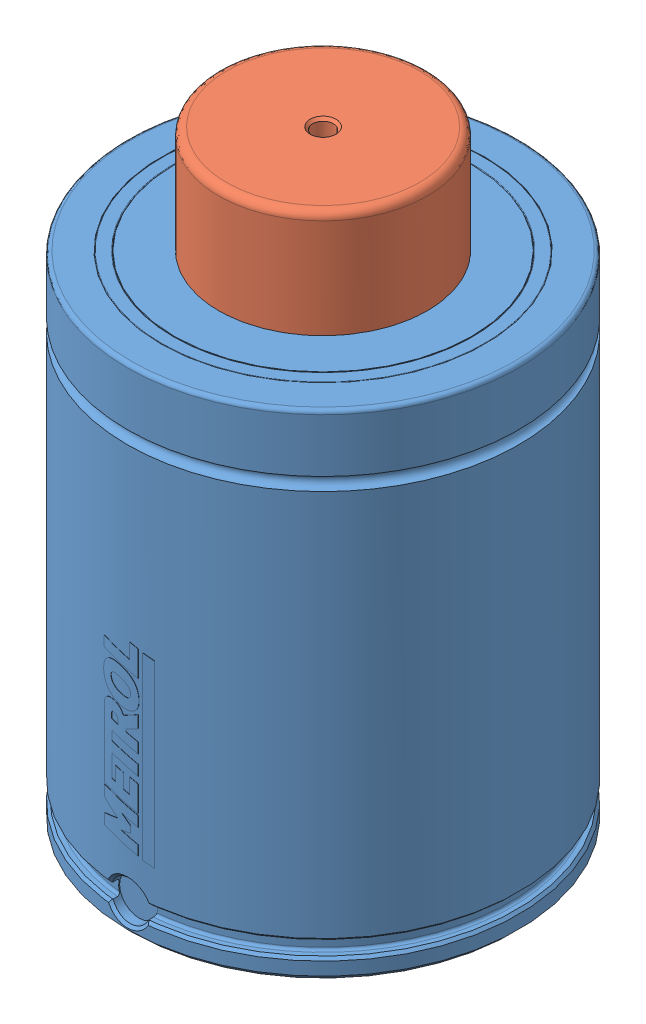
SolidWorks assembly ISNG7500-038.SLDASM, configuration Default (file format 7000). Lengths in mm.
Overall size (155.23 231 155.23).
2 component instances, 2 part files, 5 mates.
Components (placement in the parent):
- ISNG-7500 Body-1: ISNG-7500 Body.SLDPRT [ISNG7500-038] x (0 0 1) z (0 -1 0) size (150.11 150 189.9)
- ISNG-7500 Piston-1: ISNG-7500 Piston.SLDPRT [ISNG-7500-38.1] at (0 164.9 0) x (0.361006 0 0.932564) z (0 -1 0) size (120 120 66.1)
Mates (geometry in assembly coordinates):
- Concentric2: concentric aligned: cylinder of ISNG-7500 Body-1 through (0 0 0) axis (0 -1 0) radius 40; cylinder of ISNG-7500 Piston-1 through (0 164.9 0) axis (0 -1 0) radius 40
- LimitDistance1: limit distance anti-aligned: plane of ISNG-7500 Body-1 through (-40 169.9 0) normal (0 -1 0); plane of ISNG-7500 Piston-1 through (-55.9538 169.9 21.6604) normal (0 1 0)
- Coincident3: coincident anti-aligned: plane of ISNG-7500 Body-1 through (0 0 0) normal (0 -1 0); plane of assembly through (0 0 0) normal (0 1 0)
- Coincident4: coincident aligned: plane of ISNG-7500 Body-1; plane of assembly through (0 0 0) normal (0 0 1)
- Coincident6: coincident anti-aligned: plane of ISNG-7500 Body-1; plane of assembly through (0 0 0) normal (1 0 0)
